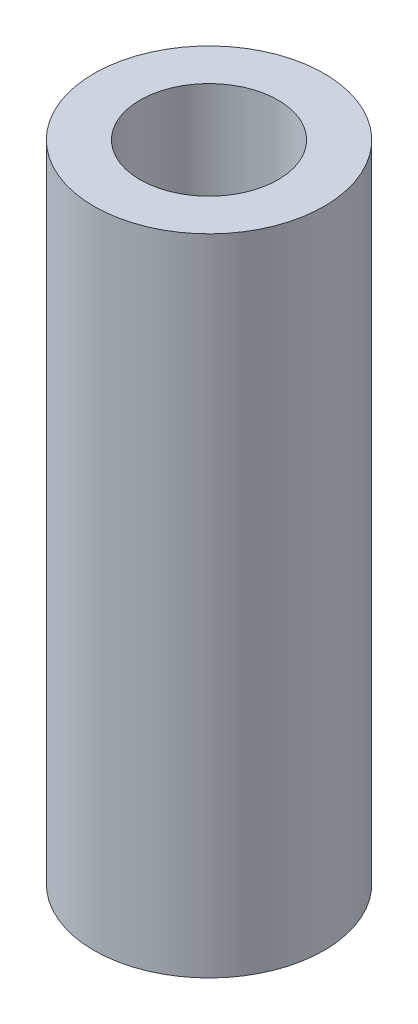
from build123d import *

# Parameters (mm, degrees)
ESQUISSE1_R          = 1.25
ESQUISSE1_R_2        = 0.75
BASE_EXTRUSION_DEPTH = 7


with BuildPart() as part:
    # Esquisse1 → Base-Extrusion (new body)
    with BuildSketch(Plane(origin=(0, 0, 0), x_dir=(1, 0, 0), z_dir=(0, 1, 0))):
        with Locations(Location((0, 0, 0), (0, 0, 270))):
            Circle(ESQUISSE1_R)
        with Locations(Location((0, 0, 0), (0, 0, 270))):
            Circle(ESQUISSE1_R_2, mode=Mode.SUBTRACT)
    extrude(amount=BASE_EXTRUSION_DEPTH)


solid = part.part
